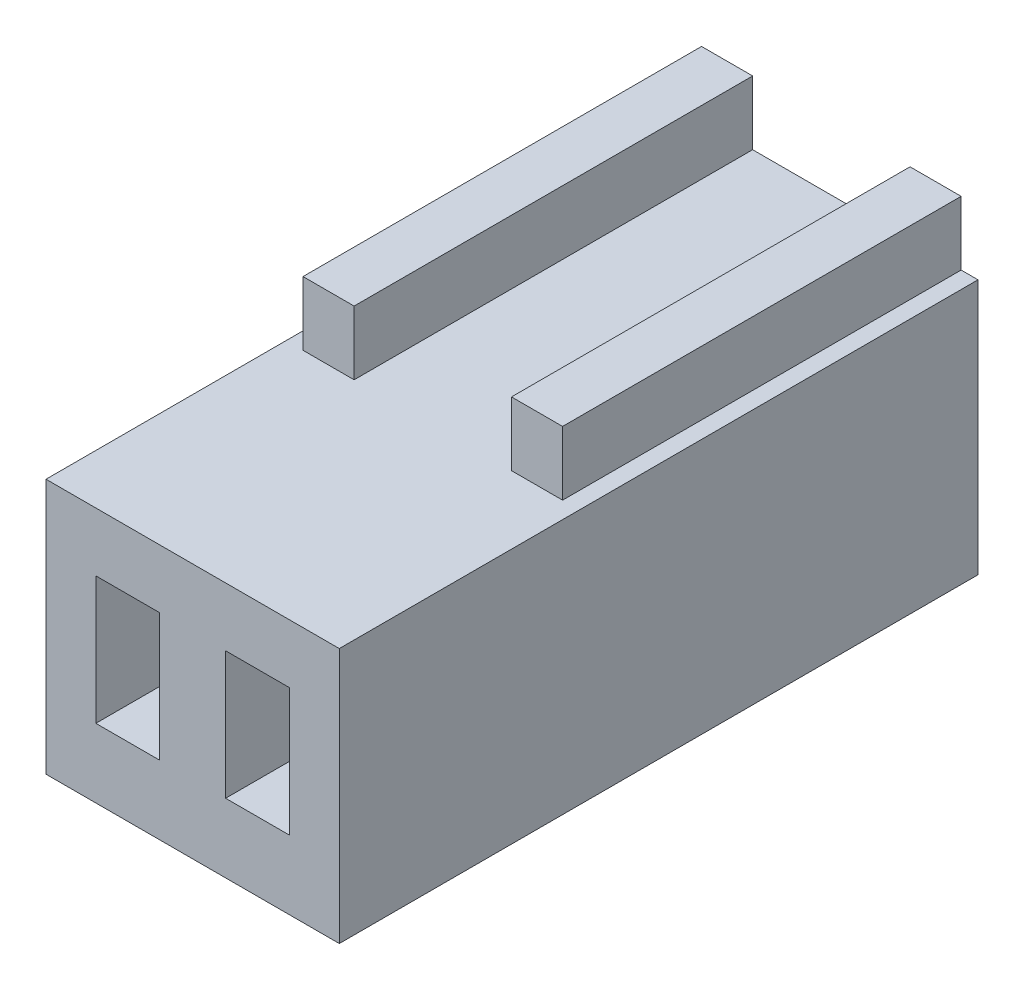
ISO-10303-21;
HEADER;
FILE_DESCRIPTION(('STEP AP214'),'2;1');
FILE_NAME('part.step','',(''),(''),'','','');
FILE_SCHEMA(('AUTOMOTIVE_DESIGN { 1 0 10303 214 1 1 1 1 }'));
ENDSEC;
DATA;
#1=APPLICATION_CONTEXT('core data for automotive mechanical design processes');
#2=APPLICATION_PROTOCOL_DEFINITION('international standard','automotive_design',2000,#1);
#3=PRODUCT_CONTEXT('',#1,'mechanical');
#4=PRODUCT('Part','Part','',(#3));
#5=PRODUCT_RELATED_PRODUCT_CATEGORY('part','',(#4));
#6=PRODUCT_DEFINITION_FORMATION('','',#4);
#7=PRODUCT_DEFINITION_CONTEXT('part definition',#1,'design');
#8=PRODUCT_DEFINITION('design','',#6,#7);
#9=PRODUCT_DEFINITION_SHAPE('','',#8);
#10=(LENGTH_UNIT() NAMED_UNIT(*) SI_UNIT(.MILLI.,.METRE.));
#11=(NAMED_UNIT(*) PLANE_ANGLE_UNIT() SI_UNIT($,.RADIAN.));
#12=(NAMED_UNIT(*) SI_UNIT($,.STERADIAN.) SOLID_ANGLE_UNIT());
#13=UNCERTAINTY_MEASURE_WITH_UNIT(LENGTH_MEASURE(1.E-05),#10,'distance_accuracy_value','');
#14=(GEOMETRIC_REPRESENTATION_CONTEXT(3) GLOBAL_UNCERTAINTY_ASSIGNED_CONTEXT((#13)) GLOBAL_UNIT_ASSIGNED_CONTEXT((#10,
#11,#12)) REPRESENTATION_CONTEXT('',''));
#15=CARTESIAN_POINT('',(0.,0.,0.));
#16=DIRECTION('',(0.,0.,1.));
#17=DIRECTION('',(1.,0.,0.));
#18=AXIS2_PLACEMENT_3D('',#15,#16,#17);
#19=CARTESIAN_POINT('',(-1.27,0.100000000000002,8.5));
#20=DIRECTION('',(0.,0.,1.));
#21=DIRECTION('',(1.,0.,0.));
#22=AXIS2_PLACEMENT_3D('',#19,#20,#21);
#23=CYLINDRICAL_SURFACE('',#22,0.5);
#24=DIRECTION('',(0.,0.,-1.));
#25=VECTOR('',#24,1.);
#26=CARTESIAN_POINT('',(-1.77,0.100000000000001,12.5));
#27=LINE('',#26,#25);
#28=CARTESIAN_POINT('',(-1.77,0.100000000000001,8.5));
#29=VERTEX_POINT('',#28);
#30=CARTESIAN_POINT('',(-1.77,0.100000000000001,10.5));
#31=VERTEX_POINT('',#30);
#32=EDGE_CURVE('E259',#29,#31,#27,.F.);
#33=ORIENTED_EDGE('',*,*,#32,.T.);
#34=CARTESIAN_POINT('',(-1.27,0.100000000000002,10.5));
#35=DIRECTION('',(0.,0.,1.));
#36=DIRECTION('',(1.,0.,0.));
#37=AXIS2_PLACEMENT_3D('',#34,#35,#36);
#38=CIRCLE('',#37,0.5);
#39=CARTESIAN_POINT('',(-0.769999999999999,0.100000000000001,10.5));
#40=VERTEX_POINT('',#39);
#41=EDGE_CURVE('E20',#40,#31,#38,.F.);
#42=ORIENTED_EDGE('',*,*,#41,.F.);
#43=DIRECTION('',(0.,0.,-1.));
#44=VECTOR('',#43,1.);
#45=CARTESIAN_POINT('',(-0.769999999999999,0.100000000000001,12.5));
#46=LINE('',#45,#44);
#47=CARTESIAN_POINT('',(-0.769999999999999,0.100000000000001,8.5));
#48=VERTEX_POINT('',#47);
#49=EDGE_CURVE('E274',#40,#48,#46,.T.);
#50=ORIENTED_EDGE('',*,*,#49,.T.);
#51=CARTESIAN_POINT('',(-1.27,0.100000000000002,8.5));
#52=DIRECTION('',(0.,0.,1.));
#53=DIRECTION('',(1.,0.,0.));
#54=AXIS2_PLACEMENT_3D('',#51,#52,#53);
#55=CIRCLE('',#54,0.5);
#56=EDGE_CURVE('E257',#29,#48,#55,.T.);
#57=ORIENTED_EDGE('',*,*,#56,.F.);
#58=EDGE_LOOP('',(#33,#42,#50,#57));
#59=FACE_BOUND('',#58,.T.);
#60=ADVANCED_FACE('F17',(#59),#23,.F.);
#61=CARTESIAN_POINT('',(-1.27,0.100000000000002,8.5));
#62=DIRECTION('',(0.,0.,1.));
#63=DIRECTION('',(1.,0.,0.));
#64=AXIS2_PLACEMENT_3D('',#61,#62,#63);
#65=PLANE('',#64);
#66=DIRECTION('',(1.,0.,0.));
#67=VECTOR('',#66,1.);
#68=CARTESIAN_POINT('',(-0.645,0.100000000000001,8.5));
#69=LINE('',#68,#67);
#70=EDGE_CURVE('E270',#48,#29,#69,.F.);
#71=ORIENTED_EDGE('',*,*,#70,.T.);
#72=ORIENTED_EDGE('',*,*,#56,.T.);
#73=EDGE_LOOP('',(#71,#72));
#74=FACE_BOUND('',#73,.T.);
#75=ADVANCED_FACE('F343',(#74),#65,.T.);
#76=CARTESIAN_POINT('',(1.27,0.100000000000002,8.5));
#77=DIRECTION('',(0.,0.,1.));
#78=DIRECTION('',(1.,0.,0.));
#79=AXIS2_PLACEMENT_3D('',#76,#77,#78);
#80=CYLINDRICAL_SURFACE('',#79,0.5);
#81=DIRECTION('',(0.,0.,-1.));
#82=VECTOR('',#81,1.);
#83=CARTESIAN_POINT('',(0.77,0.100000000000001,12.5));
#84=LINE('',#83,#82);
#85=CARTESIAN_POINT('',(0.770000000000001,0.100000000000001,8.5));
#86=VERTEX_POINT('',#85);
#87=CARTESIAN_POINT('',(0.770000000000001,0.100000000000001,10.5));
#88=VERTEX_POINT('',#87);
#89=EDGE_CURVE('E304',#86,#88,#84,.F.);
#90=ORIENTED_EDGE('',*,*,#89,.T.);
#91=CARTESIAN_POINT('',(1.27,0.100000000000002,10.5));
#92=DIRECTION('',(0.,0.,1.));
#93=DIRECTION('',(1.,0.,0.));
#94=AXIS2_PLACEMENT_3D('',#91,#92,#93);
#95=CIRCLE('',#94,0.5);
#96=CARTESIAN_POINT('',(1.77,0.100000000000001,10.5));
#97=VERTEX_POINT('',#96);
#98=EDGE_CURVE('E341',#97,#88,#95,.F.);
#99=ORIENTED_EDGE('',*,*,#98,.F.);
#100=DIRECTION('',(0.,0.,-1.));
#101=VECTOR('',#100,1.);
#102=CARTESIAN_POINT('',(1.77,0.100000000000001,12.5));
#103=LINE('',#102,#101);
#104=CARTESIAN_POINT('',(1.77,0.100000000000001,8.5));
#105=VERTEX_POINT('',#104);
#106=EDGE_CURVE('E287',#97,#105,#103,.T.);
#107=ORIENTED_EDGE('',*,*,#106,.T.);
#108=CARTESIAN_POINT('',(1.27,0.100000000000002,8.5));
#109=DIRECTION('',(0.,0.,1.));
#110=DIRECTION('',(1.,0.,0.));
#111=AXIS2_PLACEMENT_3D('',#108,#109,#110);
#112=CIRCLE('',#111,0.5);
#113=EDGE_CURVE('E286',#86,#105,#112,.T.);
#114=ORIENTED_EDGE('',*,*,#113,.F.);
#115=EDGE_LOOP('',(#90,#99,#107,#114));
#116=FACE_BOUND('',#115,.T.);
#117=ADVANCED_FACE('F726',(#116),#80,.F.);
#118=CARTESIAN_POINT('',(1.27,0.100000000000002,8.5));
#119=DIRECTION('',(0.,0.,1.));
#120=DIRECTION('',(1.,0.,0.));
#121=AXIS2_PLACEMENT_3D('',#118,#119,#120);
#122=PLANE('',#121);
#123=DIRECTION('',(1.,0.,0.));
#124=VECTOR('',#123,1.);
#125=CARTESIAN_POINT('',(1.895,0.100000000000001,8.5));
#126=LINE('',#125,#124);
#127=EDGE_CURVE('E290',#105,#86,#126,.F.);
#128=ORIENTED_EDGE('',*,*,#127,.T.);
#129=ORIENTED_EDGE('',*,*,#113,.T.);
#130=EDGE_LOOP('',(#128,#129));
#131=FACE_BOUND('',#130,.T.);
#132=ADVANCED_FACE('F738',(#131),#122,.T.);
#133=CARTESIAN_POINT('',(2.54,3.75,7.8));
#134=DIRECTION('',(0.,1.,0.));
#135=DIRECTION('',(0.,0.,1.));
#136=AXIS2_PLACEMENT_3D('',#133,#134,#135);
#137=PLANE('',#136);
#138=DIRECTION('',(1.,0.,0.));
#139=VECTOR('',#138,1.);
#140=CARTESIAN_POINT('',(0.,3.75,7.8));
#141=LINE('',#140,#139);
#142=CARTESIAN_POINT('',(2.54,3.75,7.8));
#143=VERTEX_POINT('',#142);
#144=CARTESIAN_POINT('',(1.54,3.75,7.8));
#145=VERTEX_POINT('',#144);
#146=EDGE_CURVE('E387',#143,#145,#141,.F.);
#147=ORIENTED_EDGE('',*,*,#146,.F.);
#148=DIRECTION('',(0.,0.,1.));
#149=VECTOR('',#148,1.);
#150=CARTESIAN_POINT('',(2.54,3.75,7.8));
#151=LINE('',#150,#149);
#152=CARTESIAN_POINT('',(2.54,3.75,0.));
#153=VERTEX_POINT('',#152);
#154=EDGE_CURVE('E393',#153,#143,#151,.T.);
#155=ORIENTED_EDGE('',*,*,#154,.F.);
#156=DIRECTION('',(1.,0.,0.));
#157=VECTOR('',#156,1.);
#158=CARTESIAN_POINT('',(2.54,3.75,0.));
#159=LINE('',#158,#157);
#160=CARTESIAN_POINT('',(1.54,3.75,0.));
#161=VERTEX_POINT('',#160);
#162=EDGE_CURVE('E284',#153,#161,#159,.F.);
#163=ORIENTED_EDGE('',*,*,#162,.T.);
#164=DIRECTION('',(0.,0.,1.));
#165=VECTOR('',#164,1.);
#166=CARTESIAN_POINT('',(1.54,3.75,7.8));
#167=LINE('',#166,#165);
#168=EDGE_CURVE('E384',#145,#161,#167,.F.);
#169=ORIENTED_EDGE('',*,*,#168,.F.);
#170=EDGE_LOOP('',(#147,#155,#163,#169));
#171=FACE_BOUND('',#170,.T.);
#172=ADVANCED_FACE('F740',(#171),#137,.T.);
#173=CARTESIAN_POINT('',(-2.54,3.75,7.8));
#174=DIRECTION('',(0.,-1.,0.));
#175=DIRECTION('',(0.,0.,-1.));
#176=AXIS2_PLACEMENT_3D('',#173,#174,#175);
#177=PLANE('',#176);
#178=DIRECTION('',(0.,0.,1.));
#179=VECTOR('',#178,1.);
#180=CARTESIAN_POINT('',(-2.54,3.75,7.8));
#181=LINE('',#180,#179);
#182=CARTESIAN_POINT('',(-2.54,3.75,0.));
#183=VERTEX_POINT('',#182);
#184=CARTESIAN_POINT('',(-2.54,3.75,7.8));
#185=VERTEX_POINT('',#184);
#186=EDGE_CURVE('E397',#183,#185,#181,.T.);
#187=ORIENTED_EDGE('',*,*,#186,.T.);
#188=DIRECTION('',(1.,0.,0.));
#189=VECTOR('',#188,1.);
#190=CARTESIAN_POINT('',(0.,3.75,7.8));
#191=LINE('',#190,#189);
#192=CARTESIAN_POINT('',(-1.54,3.75,7.8));
#193=VERTEX_POINT('',#192);
#194=EDGE_CURVE('E372',#193,#185,#191,.F.);
#195=ORIENTED_EDGE('',*,*,#194,.F.);
#196=DIRECTION('',(0.,0.,1.));
#197=VECTOR('',#196,1.);
#198=CARTESIAN_POINT('',(-1.54,3.75,7.8));
#199=LINE('',#198,#197);
#200=CARTESIAN_POINT('',(-1.54,3.75,0.));
#201=VERTEX_POINT('',#200);
#202=EDGE_CURVE('E377',#193,#201,#199,.F.);
#203=ORIENTED_EDGE('',*,*,#202,.T.);
#204=DIRECTION('',(1.,0.,0.));
#205=VECTOR('',#204,1.);
#206=CARTESIAN_POINT('',(-2.54,3.75,0.));
#207=LINE('',#206,#205);
#208=EDGE_CURVE('E264',#183,#201,#207,.T.);
#209=ORIENTED_EDGE('',*,*,#208,.F.);
#210=EDGE_LOOP('',(#187,#195,#203,#209));
#211=FACE_BOUND('',#210,.T.);
#212=ADVANCED_FACE('F746',(#211),#177,.F.);
#213=CARTESIAN_POINT('',(-0.645,0.100000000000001,12.5));
#214=DIRECTION('',(0.,-1.,0.));
#215=DIRECTION('',(0.,0.,-1.));
#216=AXIS2_PLACEMENT_3D('',#213,#214,#215);
#217=PLANE('',#216);
#218=ORIENTED_EDGE('',*,*,#49,.F.);
#219=DIRECTION('',(-1.,0.,0.));
#220=VECTOR('',#219,1.);
#221=CARTESIAN_POINT('',(-2.54,0.100000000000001,10.5));
#222=LINE('',#221,#220);
#223=CARTESIAN_POINT('',(-0.645,0.100000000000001,10.5));
#224=VERTEX_POINT('',#223);
#225=EDGE_CURVE('E256',#40,#224,#222,.F.);
#226=ORIENTED_EDGE('',*,*,#225,.T.);
#227=DIRECTION('',(0.,0.,1.));
#228=VECTOR('',#227,1.);
#229=CARTESIAN_POINT('',(-0.645,0.100000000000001,12.5));
#230=LINE('',#229,#228);
#231=CARTESIAN_POINT('',(-0.645,0.100000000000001,0.));
#232=VERTEX_POINT('',#231);
#233=EDGE_CURVE('E322',#224,#232,#230,.F.);
#234=ORIENTED_EDGE('',*,*,#233,.T.);
#235=DIRECTION('',(1.,0.,0.));
#236=VECTOR('',#235,1.);
#237=CARTESIAN_POINT('',(-0.645,0.100000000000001,0.));
#238=LINE('',#237,#236);
#239=CARTESIAN_POINT('',(-1.895,0.100000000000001,0.));
#240=VERTEX_POINT('',#239);
#241=EDGE_CURVE('E263',#240,#232,#238,.T.);
#242=ORIENTED_EDGE('',*,*,#241,.F.);
#243=DIRECTION('',(0.,0.,1.));
#244=VECTOR('',#243,1.);
#245=CARTESIAN_POINT('',(-1.895,0.100000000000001,12.5));
#246=LINE('',#245,#244);
#247=CARTESIAN_POINT('',(-1.895,0.100000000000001,10.5));
#248=VERTEX_POINT('',#247);
#249=EDGE_CURVE('E269',#240,#248,#246,.T.);
#250=ORIENTED_EDGE('',*,*,#249,.T.);
#251=DIRECTION('',(-1.,0.,0.));
#252=VECTOR('',#251,1.);
#253=CARTESIAN_POINT('',(-2.54,0.100000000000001,10.5));
#254=LINE('',#253,#252);
#255=EDGE_CURVE('E253',#248,#31,#254,.F.);
#256=ORIENTED_EDGE('',*,*,#255,.T.);
#257=ORIENTED_EDGE('',*,*,#32,.F.);
#258=ORIENTED_EDGE('',*,*,#70,.F.);
#259=EDGE_LOOP('',(#218,#226,#234,#242,#250,#256,#257,#258));
#260=FACE_BOUND('',#259,.T.);
#261=ADVANCED_FACE('F267',(#260),#217,.F.);
#262=CARTESIAN_POINT('',(-2.54,0.,10.5));
#263=DIRECTION('',(0.,0.,-1.));
#264=DIRECTION('',(-1.,0.,0.));
#265=AXIS2_PLACEMENT_3D('',#262,#263,#264);
#266=PLANE('',#265);
#267=ORIENTED_EDGE('',*,*,#41,.T.);
#268=ORIENTED_EDGE('',*,*,#255,.F.);
#269=DIRECTION('',(0.,-1.,0.));
#270=VECTOR('',#269,1.);
#271=CARTESIAN_POINT('',(-1.895,1.35,10.5));
#272=LINE('',#271,#270);
#273=CARTESIAN_POINT('',(-1.895,-1.15,10.5));
#274=VERTEX_POINT('',#273);
#275=EDGE_CURVE('E332',#248,#274,#272,.T.);
#276=ORIENTED_EDGE('',*,*,#275,.T.);
#277=DIRECTION('',(1.,0.,0.));
#278=VECTOR('',#277,1.);
#279=CARTESIAN_POINT('',(-1.895,-1.15,10.5));
#280=LINE('',#279,#278);
#281=CARTESIAN_POINT('',(-0.645,-1.15,10.5));
#282=VERTEX_POINT('',#281);
#283=EDGE_CURVE('E272',#274,#282,#280,.T.);
#284=ORIENTED_EDGE('',*,*,#283,.T.);
#285=DIRECTION('',(0.,1.,0.));
#286=VECTOR('',#285,1.);
#287=CARTESIAN_POINT('',(-0.645,1.35,10.5));
#288=LINE('',#287,#286);
#289=EDGE_CURVE('E325',#282,#224,#288,.T.);
#290=ORIENTED_EDGE('',*,*,#289,.T.);
#291=ORIENTED_EDGE('',*,*,#225,.F.);
#292=EDGE_LOOP('',(#267,#268,#276,#284,#290,#291));
#293=FACE_BOUND('',#292,.T.);
#294=ADVANCED_FACE('F250',(#293),#266,.F.);
#295=CARTESIAN_POINT('',(-1.895,-1.15,10.5));
#296=DIRECTION('',(0.,-1.,0.));
#297=DIRECTION('',(0.,0.,-1.));
#298=AXIS2_PLACEMENT_3D('',#295,#296,#297);
#299=PLANE('',#298);
#300=DIRECTION('',(0.,0.,1.));
#301=VECTOR('',#300,1.);
#302=CARTESIAN_POINT('',(-0.645000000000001,-1.15,12.5));
#303=LINE('',#302,#301);
#304=CARTESIAN_POINT('',(-0.645,-1.15,12.5));
#305=VERTEX_POINT('',#304);
#306=EDGE_CURVE('E329',#305,#282,#303,.F.);
#307=ORIENTED_EDGE('',*,*,#306,.T.);
#308=ORIENTED_EDGE('',*,*,#283,.F.);
#309=DIRECTION('',(0.,0.,1.));
#310=VECTOR('',#309,1.);
#311=CARTESIAN_POINT('',(-1.895,-1.15,12.5));
#312=LINE('',#311,#310);
#313=CARTESIAN_POINT('',(-1.895,-1.15,12.5));
#314=VERTEX_POINT('',#313);
#315=EDGE_CURVE('E334',#274,#314,#312,.T.);
#316=ORIENTED_EDGE('',*,*,#315,.T.);
#317=DIRECTION('',(1.,0.,0.));
#318=VECTOR('',#317,1.);
#319=CARTESIAN_POINT('',(-1.895,-1.15,12.5));
#320=LINE('',#319,#318);
#321=EDGE_CURVE('E307',#305,#314,#320,.F.);
#322=ORIENTED_EDGE('',*,*,#321,.F.);
#323=EDGE_LOOP('',(#307,#308,#316,#322));
#324=FACE_BOUND('',#323,.T.);
#325=ADVANCED_FACE('F603',(#324),#299,.F.);
#326=CARTESIAN_POINT('',(1.895,0.100000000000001,12.5));
#327=DIRECTION('',(0.,-1.,0.));
#328=DIRECTION('',(0.,0.,-1.));
#329=AXIS2_PLACEMENT_3D('',#326,#327,#328);
#330=PLANE('',#329);
#331=ORIENTED_EDGE('',*,*,#106,.F.);
#332=DIRECTION('',(-1.,0.,0.));
#333=VECTOR('',#332,1.);
#334=CARTESIAN_POINT('',(0.,0.100000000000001,10.5));
#335=LINE('',#334,#333);
#336=CARTESIAN_POINT('',(1.895,0.100000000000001,10.5));
#337=VERTEX_POINT('',#336);
#338=EDGE_CURVE('E364',#97,#337,#335,.F.);
#339=ORIENTED_EDGE('',*,*,#338,.T.);
#340=DIRECTION('',(0.,0.,1.));
#341=VECTOR('',#340,1.);
#342=CARTESIAN_POINT('',(1.895,0.100000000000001,12.5));
#343=LINE('',#342,#341);
#344=CARTESIAN_POINT('',(1.895,0.100000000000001,0.));
#345=VERTEX_POINT('',#344);
#346=EDGE_CURVE('E292',#337,#345,#343,.F.);
#347=ORIENTED_EDGE('',*,*,#346,.T.);
#348=DIRECTION('',(1.,0.,0.));
#349=VECTOR('',#348,1.);
#350=CARTESIAN_POINT('',(1.895,0.100000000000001,0.));
#351=LINE('',#350,#349);
#352=CARTESIAN_POINT('',(0.645,0.100000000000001,0.));
#353=VERTEX_POINT('',#352);
#354=EDGE_CURVE('E291',#353,#345,#351,.T.);
#355=ORIENTED_EDGE('',*,*,#354,.F.);
#356=DIRECTION('',(0.,0.,1.));
#357=VECTOR('',#356,1.);
#358=CARTESIAN_POINT('',(0.645,0.100000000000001,12.5));
#359=LINE('',#358,#357);
#360=CARTESIAN_POINT('',(0.644999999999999,0.100000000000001,10.5));
#361=VERTEX_POINT('',#360);
#362=EDGE_CURVE('E295',#353,#361,#359,.T.);
#363=ORIENTED_EDGE('',*,*,#362,.T.);
#364=DIRECTION('',(-1.,0.,0.));
#365=VECTOR('',#364,1.);
#366=CARTESIAN_POINT('',(0.,0.100000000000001,10.5));
#367=LINE('',#366,#365);
#368=EDGE_CURVE('E320',#361,#88,#367,.F.);
#369=ORIENTED_EDGE('',*,*,#368,.T.);
#370=ORIENTED_EDGE('',*,*,#89,.F.);
#371=ORIENTED_EDGE('',*,*,#127,.F.);
#372=EDGE_LOOP('',(#331,#339,#347,#355,#363,#369,#370,#371));
#373=FACE_BOUND('',#372,.T.);
#374=ADVANCED_FACE('F605',(#373),#330,.F.);
#375=CARTESIAN_POINT('',(0.,0.,10.5));
#376=DIRECTION('',(0.,0.,-1.));
#377=DIRECTION('',(-1.,0.,0.));
#378=AXIS2_PLACEMENT_3D('',#375,#376,#377);
#379=PLANE('',#378);
#380=ORIENTED_EDGE('',*,*,#98,.T.);
#381=ORIENTED_EDGE('',*,*,#368,.F.);
#382=DIRECTION('',(0.,-1.,0.));
#383=VECTOR('',#382,1.);
#384=CARTESIAN_POINT('',(0.645,1.35,10.5));
#385=LINE('',#384,#383);
#386=CARTESIAN_POINT('',(0.644999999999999,-1.15,10.5));
#387=VERTEX_POINT('',#386);
#388=EDGE_CURVE('E308',#361,#387,#385,.T.);
#389=ORIENTED_EDGE('',*,*,#388,.T.);
#390=DIRECTION('',(1.,0.,0.));
#391=VECTOR('',#390,1.);
#392=CARTESIAN_POINT('',(0.644999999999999,-1.15,10.5));
#393=LINE('',#392,#391);
#394=CARTESIAN_POINT('',(1.895,-1.15,10.5));
#395=VERTEX_POINT('',#394);
#396=EDGE_CURVE('E368',#387,#395,#393,.T.);
#397=ORIENTED_EDGE('',*,*,#396,.T.);
#398=DIRECTION('',(0.,1.,0.));
#399=VECTOR('',#398,1.);
#400=CARTESIAN_POINT('',(1.895,1.35,10.5));
#401=LINE('',#400,#399);
#402=EDGE_CURVE('E296',#395,#337,#401,.T.);
#403=ORIENTED_EDGE('',*,*,#402,.T.);
#404=ORIENTED_EDGE('',*,*,#338,.F.);
#405=EDGE_LOOP('',(#380,#381,#389,#397,#403,#404));
#406=FACE_BOUND('',#405,.T.);
#407=ADVANCED_FACE('F612',(#406),#379,.F.);
#408=CARTESIAN_POINT('',(0.644999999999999,-1.15,10.5));
#409=DIRECTION('',(0.,-1.,0.));
#410=DIRECTION('',(0.,0.,-1.));
#411=AXIS2_PLACEMENT_3D('',#408,#409,#410);
#412=PLANE('',#411);
#413=DIRECTION('',(0.,0.,1.));
#414=VECTOR('',#413,1.);
#415=CARTESIAN_POINT('',(1.895,-1.15,12.5));
#416=LINE('',#415,#414);
#417=CARTESIAN_POINT('',(1.895,-1.15,12.5));
#418=VERTEX_POINT('',#417);
#419=EDGE_CURVE('E301',#418,#395,#416,.F.);
#420=ORIENTED_EDGE('',*,*,#419,.T.);
#421=ORIENTED_EDGE('',*,*,#396,.F.);
#422=DIRECTION('',(0.,0.,1.));
#423=VECTOR('',#422,1.);
#424=CARTESIAN_POINT('',(0.645,-1.15,12.5));
#425=LINE('',#424,#423);
#426=CARTESIAN_POINT('',(0.644999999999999,-1.15,12.5));
#427=VERTEX_POINT('',#426);
#428=EDGE_CURVE('E311',#387,#427,#425,.T.);
#429=ORIENTED_EDGE('',*,*,#428,.T.);
#430=DIRECTION('',(1.,0.,0.));
#431=VECTOR('',#430,1.);
#432=CARTESIAN_POINT('',(0.644999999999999,-1.15,12.5));
#433=LINE('',#432,#431);
#434=EDGE_CURVE('E370',#418,#427,#433,.F.);
#435=ORIENTED_EDGE('',*,*,#434,.F.);
#436=EDGE_LOOP('',(#420,#421,#429,#435));
#437=FACE_BOUND('',#436,.T.);
#438=ADVANCED_FACE('F712',(#437),#412,.F.);
#439=CARTESIAN_POINT('',(0.,0.,7.8));
#440=DIRECTION('',(0.,0.,1.));
#441=DIRECTION('',(1.,0.,0.));
#442=AXIS2_PLACEMENT_3D('',#439,#440,#441);
#443=PLANE('',#442);
#444=DIRECTION('',(0.,1.,0.));
#445=VECTOR('',#444,1.);
#446=CARTESIAN_POINT('',(-1.54,2.5,7.8));
#447=LINE('',#446,#445);
#448=CARTESIAN_POINT('',(-1.54,2.5,7.8));
#449=VERTEX_POINT('',#448);
#450=EDGE_CURVE('E374',#449,#193,#447,.T.);
#451=ORIENTED_EDGE('',*,*,#450,.T.);
#452=ORIENTED_EDGE('',*,*,#194,.T.);
#453=DIRECTION('',(0.,1.,0.));
#454=VECTOR('',#453,1.);
#455=CARTESIAN_POINT('',(-2.54,2.5,7.8));
#456=LINE('',#455,#454);
#457=CARTESIAN_POINT('',(-2.54,2.5,7.8));
#458=VERTEX_POINT('',#457);
#459=EDGE_CURVE('E400',#185,#458,#456,.F.);
#460=ORIENTED_EDGE('',*,*,#459,.T.);
#461=DIRECTION('',(1.,0.,0.));
#462=VECTOR('',#461,1.);
#463=CARTESIAN_POINT('',(-2.87,2.5,7.8));
#464=LINE('',#463,#462);
#465=EDGE_CURVE('E434',#458,#449,#464,.T.);
#466=ORIENTED_EDGE('',*,*,#465,.T.);
#467=EDGE_LOOP('',(#451,#452,#460,#466));
#468=FACE_BOUND('',#467,.T.);
#469=ADVANCED_FACE('F708',(#468),#443,.T.);
#470=CARTESIAN_POINT('',(-1.54,2.5,7.8));
#471=DIRECTION('',(-1.,0.,0.));
#472=DIRECTION('',(0.,0.,1.));
#473=AXIS2_PLACEMENT_3D('',#470,#471,#472);
#474=PLANE('',#473);
#475=ORIENTED_EDGE('',*,*,#202,.F.);
#476=ORIENTED_EDGE('',*,*,#450,.F.);
#477=DIRECTION('',(0.,0.,-1.));
#478=VECTOR('',#477,1.);
#479=CARTESIAN_POINT('',(-1.54,2.5,12.5));
#480=LINE('',#479,#478);
#481=CARTESIAN_POINT('',(-1.54,2.5,0.));
#482=VERTEX_POINT('',#481);
#483=EDGE_CURVE('E437',#449,#482,#480,.T.);
#484=ORIENTED_EDGE('',*,*,#483,.T.);
#485=DIRECTION('',(0.,1.,0.));
#486=VECTOR('',#485,1.);
#487=CARTESIAN_POINT('',(-1.54,2.5,0.));
#488=LINE('',#487,#486);
#489=EDGE_CURVE('E380',#201,#482,#488,.F.);
#490=ORIENTED_EDGE('',*,*,#489,.F.);
#491=EDGE_LOOP('',(#475,#476,#484,#490));
#492=FACE_BOUND('',#491,.T.);
#493=ADVANCED_FACE('F704',(#492),#474,.F.);
#494=CARTESIAN_POINT('',(1.54,2.5,7.8));
#495=DIRECTION('',(-1.,0.,0.));
#496=DIRECTION('',(0.,0.,1.));
#497=AXIS2_PLACEMENT_3D('',#494,#495,#496);
#498=PLANE('',#497);
#499=DIRECTION('',(0.,1.,0.));
#500=VECTOR('',#499,1.);
#501=CARTESIAN_POINT('',(1.54,0.,7.8));
#502=LINE('',#501,#500);
#503=CARTESIAN_POINT('',(1.54,2.5,7.8));
#504=VERTEX_POINT('',#503);
#505=EDGE_CURVE('E389',#145,#504,#502,.F.);
#506=ORIENTED_EDGE('',*,*,#505,.F.);
#507=ORIENTED_EDGE('',*,*,#168,.T.);
#508=DIRECTION('',(0.,1.,0.));
#509=VECTOR('',#508,1.);
#510=CARTESIAN_POINT('',(1.54,2.5,0.));
#511=LINE('',#510,#509);
#512=CARTESIAN_POINT('',(1.54,2.5,0.));
#513=VERTEX_POINT('',#512);
#514=EDGE_CURVE('E382',#161,#513,#511,.F.);
#515=ORIENTED_EDGE('',*,*,#514,.T.);
#516=DIRECTION('',(0.,0.,-1.));
#517=VECTOR('',#516,1.);
#518=CARTESIAN_POINT('',(1.54,2.5,12.5));
#519=LINE('',#518,#517);
#520=EDGE_CURVE('E440',#513,#504,#519,.F.);
#521=ORIENTED_EDGE('',*,*,#520,.T.);
#522=EDGE_LOOP('',(#506,#507,#515,#521));
#523=FACE_BOUND('',#522,.T.);
#524=ADVANCED_FACE('F700',(#523),#498,.T.);
#525=CARTESIAN_POINT('',(0.,0.,7.8));
#526=DIRECTION('',(0.,0.,1.));
#527=DIRECTION('',(1.,0.,0.));
#528=AXIS2_PLACEMENT_3D('',#525,#526,#527);
#529=PLANE('',#528);
#530=ORIENTED_EDGE('',*,*,#505,.T.);
#531=DIRECTION('',(1.,0.,0.));
#532=VECTOR('',#531,1.);
#533=CARTESIAN_POINT('',(-2.87,2.5,7.8));
#534=LINE('',#533,#532);
#535=CARTESIAN_POINT('',(2.54,2.5,7.8));
#536=VERTEX_POINT('',#535);
#537=EDGE_CURVE('E443',#504,#536,#534,.T.);
#538=ORIENTED_EDGE('',*,*,#537,.T.);
#539=DIRECTION('',(0.,1.,0.));
#540=VECTOR('',#539,1.);
#541=CARTESIAN_POINT('',(2.54,2.5,7.8));
#542=LINE('',#541,#540);
#543=EDGE_CURVE('E395',#143,#536,#542,.F.);
#544=ORIENTED_EDGE('',*,*,#543,.F.);
#545=ORIENTED_EDGE('',*,*,#146,.T.);
#546=EDGE_LOOP('',(#530,#538,#544,#545));
#547=FACE_BOUND('',#546,.T.);
#548=ADVANCED_FACE('F696',(#547),#529,.T.);
#549=CARTESIAN_POINT('',(2.54,2.5,7.8));
#550=DIRECTION('',(1.,0.,0.));
#551=DIRECTION('',(0.,1.,0.));
#552=AXIS2_PLACEMENT_3D('',#549,#550,#551);
#553=PLANE('',#552);
#554=ORIENTED_EDGE('',*,*,#543,.T.);
#555=DIRECTION('',(0.,0.,-1.));
#556=VECTOR('',#555,1.);
#557=CARTESIAN_POINT('',(2.54,2.5,12.5));
#558=LINE('',#557,#556);
#559=CARTESIAN_POINT('',(2.54,2.5,0.));
#560=VERTEX_POINT('',#559);
#561=EDGE_CURVE('E446',#536,#560,#558,.T.);
#562=ORIENTED_EDGE('',*,*,#561,.T.);
#563=DIRECTION('',(0.,1.,0.));
#564=VECTOR('',#563,1.);
#565=CARTESIAN_POINT('',(2.54,2.5,0.));
#566=LINE('',#565,#564);
#567=EDGE_CURVE('E391',#560,#153,#566,.T.);
#568=ORIENTED_EDGE('',*,*,#567,.T.);
#569=ORIENTED_EDGE('',*,*,#154,.T.);
#570=EDGE_LOOP('',(#554,#562,#568,#569));
#571=FACE_BOUND('',#570,.T.);
#572=ADVANCED_FACE('F692',(#571),#553,.T.);
#573=CARTESIAN_POINT('',(-2.54,2.5,7.8));
#574=DIRECTION('',(1.,0.,0.));
#575=DIRECTION('',(0.,1.,0.));
#576=AXIS2_PLACEMENT_3D('',#573,#574,#575);
#577=PLANE('',#576);
#578=DIRECTION('',(0.,0.,-1.));
#579=VECTOR('',#578,1.);
#580=CARTESIAN_POINT('',(-2.54,2.5,12.5));
#581=LINE('',#580,#579);
#582=CARTESIAN_POINT('',(-2.54,2.5,0.));
#583=VERTEX_POINT('',#582);
#584=EDGE_CURVE('E452',#583,#458,#581,.F.);
#585=ORIENTED_EDGE('',*,*,#584,.T.);
#586=ORIENTED_EDGE('',*,*,#459,.F.);
#587=ORIENTED_EDGE('',*,*,#186,.F.);
#588=DIRECTION('',(0.,1.,0.));
#589=VECTOR('',#588,1.);
#590=CARTESIAN_POINT('',(-2.54,2.5,0.));
#591=LINE('',#590,#589);
#592=EDGE_CURVE('E403',#583,#183,#591,.T.);
#593=ORIENTED_EDGE('',*,*,#592,.F.);
#594=EDGE_LOOP('',(#585,#586,#587,#593));
#595=FACE_BOUND('',#594,.T.);
#596=ADVANCED_FACE('F688',(#595),#577,.F.);
#597=CARTESIAN_POINT('',(0.,-1.5,0.));
#598=DIRECTION('',(0.,1.,0.));
#599=DIRECTION('',(0.,0.,1.));
#600=AXIS2_PLACEMENT_3D('',#597,#598,#599);
#601=PLANE('',#600);
#602=DIRECTION('',(0.,0.,-1.));
#603=VECTOR('',#602,1.);
#604=CARTESIAN_POINT('',(1.72,-1.5,1.8));
#605=LINE('',#604,#603);
#606=CARTESIAN_POINT('',(1.72,-1.5,1.8));
#607=VERTEX_POINT('',#606);
#608=CARTESIAN_POINT('',(1.72,-1.5,4.98));
#609=VERTEX_POINT('',#608);
#610=EDGE_CURVE('E470',#607,#609,#605,.F.);
#611=ORIENTED_EDGE('',*,*,#610,.T.);
#612=DIRECTION('',(1.,0.,0.));
#613=VECTOR('',#612,1.);
#614=CARTESIAN_POINT('',(1.72,-1.5,4.98));
#615=LINE('',#614,#613);
#616=CARTESIAN_POINT('',(0.72,-1.5,4.98));
#617=VERTEX_POINT('',#616);
#618=EDGE_CURVE('E455',#609,#617,#615,.F.);
#619=ORIENTED_EDGE('',*,*,#618,.T.);
#620=DIRECTION('',(0.,0.,1.));
#621=VECTOR('',#620,1.);
#622=CARTESIAN_POINT('',(0.72,-1.5,1.8));
#623=LINE('',#622,#621);
#624=CARTESIAN_POINT('',(0.72,-1.5,1.8));
#625=VERTEX_POINT('',#624);
#626=EDGE_CURVE('E460',#617,#625,#623,.F.);
#627=ORIENTED_EDGE('',*,*,#626,.T.);
#628=DIRECTION('',(-1.,0.,0.));
#629=VECTOR('',#628,1.);
#630=CARTESIAN_POINT('',(1.72,-1.5,1.8));
#631=LINE('',#630,#629);
#632=EDGE_CURVE('E465',#625,#607,#631,.F.);
#633=ORIENTED_EDGE('',*,*,#632,.T.);
#634=EDGE_LOOP('',(#611,#619,#627,#633));
#635=FACE_BOUND('',#634,.T.);
#636=ADVANCED_FACE('F684',(#635),#601,.F.);
#637=CARTESIAN_POINT('',(0.,-1.5,0.));
#638=DIRECTION('',(0.,1.,0.));
#639=DIRECTION('',(0.,0.,1.));
#640=AXIS2_PLACEMENT_3D('',#637,#638,#639);
#641=PLANE('',#640);
#642=DIRECTION('',(1.,0.,0.));
#643=VECTOR('',#642,1.);
#644=CARTESIAN_POINT('',(0.,-1.5,1.8));
#645=LINE('',#644,#643);
#646=CARTESIAN_POINT('',(-0.72,-1.5,1.8));
#647=VERTEX_POINT('',#646);
#648=CARTESIAN_POINT('',(-1.72,-1.5,1.8));
#649=VERTEX_POINT('',#648);
#650=EDGE_CURVE('E406',#647,#649,#645,.F.);
#651=ORIENTED_EDGE('',*,*,#650,.F.);
#652=DIRECTION('',(0.,0.,-1.));
#653=VECTOR('',#652,1.);
#654=CARTESIAN_POINT('',(-0.72,-1.5,1.8));
#655=LINE('',#654,#653);
#656=CARTESIAN_POINT('',(-0.72,-1.5,4.98));
#657=VERTEX_POINT('',#656);
#658=EDGE_CURVE('E476',#647,#657,#655,.F.);
#659=ORIENTED_EDGE('',*,*,#658,.T.);
#660=DIRECTION('',(1.,0.,0.));
#661=VECTOR('',#660,1.);
#662=CARTESIAN_POINT('',(-1.72,-1.5,4.98));
#663=LINE('',#662,#661);
#664=CARTESIAN_POINT('',(-1.72,-1.5,4.98));
#665=VERTEX_POINT('',#664);
#666=EDGE_CURVE('E481',#657,#665,#663,.F.);
#667=ORIENTED_EDGE('',*,*,#666,.T.);
#668=DIRECTION('',(0.,0.,1.));
#669=VECTOR('',#668,1.);
#670=CARTESIAN_POINT('',(-1.72,-1.5,1.8));
#671=LINE('',#670,#669);
#672=EDGE_CURVE('E486',#665,#649,#671,.F.);
#673=ORIENTED_EDGE('',*,*,#672,.T.);
#674=EDGE_LOOP('',(#651,#659,#667,#673));
#675=FACE_BOUND('',#674,.T.);
#676=ADVANCED_FACE('F681',(#675),#641,.F.);
#677=CARTESIAN_POINT('',(-0.645,1.35,12.5));
#678=DIRECTION('',(1.,0.,0.));
#679=DIRECTION('',(0.,1.,0.));
#680=AXIS2_PLACEMENT_3D('',#677,#678,#679);
#681=PLANE('',#680);
#682=ORIENTED_EDGE('',*,*,#289,.F.);
#683=ORIENTED_EDGE('',*,*,#306,.F.);
#684=DIRECTION('',(0.,1.,0.));
#685=VECTOR('',#684,1.);
#686=CARTESIAN_POINT('',(-0.645,0.,12.5));
#687=LINE('',#686,#685);
#688=CARTESIAN_POINT('',(-0.645,1.35,12.5));
#689=VERTEX_POINT('',#688);
#690=EDGE_CURVE('E498',#689,#305,#687,.F.);
#691=ORIENTED_EDGE('',*,*,#690,.F.);
#692=DIRECTION('',(0.,0.,1.));
#693=VECTOR('',#692,1.);
#694=CARTESIAN_POINT('',(-0.645,1.35,12.5));
#695=LINE('',#694,#693);
#696=CARTESIAN_POINT('',(-0.645,1.35,0.));
#697=VERTEX_POINT('',#696);
#698=EDGE_CURVE('E426',#689,#697,#695,.F.);
#699=ORIENTED_EDGE('',*,*,#698,.T.);
#700=DIRECTION('',(0.,1.,0.));
#701=VECTOR('',#700,1.);
#702=CARTESIAN_POINT('',(-0.645,1.35,0.));
#703=LINE('',#702,#701);
#704=EDGE_CURVE('E351',#232,#697,#703,.T.);
#705=ORIENTED_EDGE('',*,*,#704,.F.);
#706=ORIENTED_EDGE('',*,*,#233,.F.);
#707=EDGE_LOOP('',(#682,#683,#691,#699,#705,#706));
#708=FACE_BOUND('',#707,.T.);
#709=ADVANCED_FACE('F347',(#708),#681,.F.);
#710=CARTESIAN_POINT('',(-1.895,1.35,12.5));
#711=DIRECTION('',(-1.,0.,0.));
#712=DIRECTION('',(0.,-1.,0.));
#713=AXIS2_PLACEMENT_3D('',#710,#711,#712);
#714=PLANE('',#713);
#715=DIRECTION('',(0.,0.,1.));
#716=VECTOR('',#715,1.);
#717=CARTESIAN_POINT('',(-1.895,1.35,12.5));
#718=LINE('',#717,#716);
#719=CARTESIAN_POINT('',(-1.895,1.35,0.));
#720=VERTEX_POINT('',#719);
#721=CARTESIAN_POINT('',(-1.895,1.35,12.5));
#722=VERTEX_POINT('',#721);
#723=EDGE_CURVE('E423',#720,#722,#718,.T.);
#724=ORIENTED_EDGE('',*,*,#723,.T.);
#725=DIRECTION('',(0.,1.,0.));
#726=VECTOR('',#725,1.);
#727=CARTESIAN_POINT('',(-1.895,0.,12.5));
#728=LINE('',#727,#726);
#729=EDGE_CURVE('E501',#314,#722,#728,.T.);
#730=ORIENTED_EDGE('',*,*,#729,.F.);
#731=ORIENTED_EDGE('',*,*,#315,.F.);
#732=ORIENTED_EDGE('',*,*,#275,.F.);
#733=ORIENTED_EDGE('',*,*,#249,.F.);
#734=DIRECTION('',(0.,-1.,0.));
#735=VECTOR('',#734,1.);
#736=CARTESIAN_POINT('',(-1.895,1.35,0.));
#737=LINE('',#736,#735);
#738=EDGE_CURVE('E411',#720,#240,#737,.T.);
#739=ORIENTED_EDGE('',*,*,#738,.F.);
#740=EDGE_LOOP('',(#724,#730,#731,#732,#733,#739));
#741=FACE_BOUND('',#740,.T.);
#742=ADVANCED_FACE('F596',(#741),#714,.F.);
#743=CARTESIAN_POINT('',(1.895,1.35,12.5));
#744=DIRECTION('',(1.,0.,0.));
#745=DIRECTION('',(0.,1.,0.));
#746=AXIS2_PLACEMENT_3D('',#743,#744,#745);
#747=PLANE('',#746);
#748=ORIENTED_EDGE('',*,*,#402,.F.);
#749=ORIENTED_EDGE('',*,*,#419,.F.);
#750=DIRECTION('',(0.,1.,0.));
#751=VECTOR('',#750,1.);
#752=CARTESIAN_POINT('',(1.895,0.,12.5));
#753=LINE('',#752,#751);
#754=CARTESIAN_POINT('',(1.895,1.35,12.5));
#755=VERTEX_POINT('',#754);
#756=EDGE_CURVE('E506',#755,#418,#753,.F.);
#757=ORIENTED_EDGE('',*,*,#756,.F.);
#758=DIRECTION('',(0.,0.,1.));
#759=VECTOR('',#758,1.);
#760=CARTESIAN_POINT('',(1.895,1.35,12.5));
#761=LINE('',#760,#759);
#762=CARTESIAN_POINT('',(1.895,1.35,0.));
#763=VERTEX_POINT('',#762);
#764=EDGE_CURVE('E431',#755,#763,#761,.F.);
#765=ORIENTED_EDGE('',*,*,#764,.T.);
#766=DIRECTION('',(0.,1.,0.));
#767=VECTOR('',#766,1.);
#768=CARTESIAN_POINT('',(1.895,1.35,0.));
#769=LINE('',#768,#767);
#770=EDGE_CURVE('E414',#345,#763,#769,.T.);
#771=ORIENTED_EDGE('',*,*,#770,.F.);
#772=ORIENTED_EDGE('',*,*,#346,.F.);
#773=EDGE_LOOP('',(#748,#749,#757,#765,#771,#772));
#774=FACE_BOUND('',#773,.T.);
#775=ADVANCED_FACE('F672',(#774),#747,.F.);
#776=CARTESIAN_POINT('',(0.645,1.35,12.5));
#777=DIRECTION('',(-1.,0.,0.));
#778=DIRECTION('',(0.,-1.,0.));
#779=AXIS2_PLACEMENT_3D('',#776,#777,#778);
#780=PLANE('',#779);
#781=DIRECTION('',(0.,0.,1.));
#782=VECTOR('',#781,1.);
#783=CARTESIAN_POINT('',(0.645,1.35,12.5));
#784=LINE('',#783,#782);
#785=CARTESIAN_POINT('',(0.645,1.35,0.));
#786=VERTEX_POINT('',#785);
#787=CARTESIAN_POINT('',(0.645,1.35,12.5));
#788=VERTEX_POINT('',#787);
#789=EDGE_CURVE('E428',#786,#788,#784,.T.);
#790=ORIENTED_EDGE('',*,*,#789,.T.);
#791=DIRECTION('',(0.,1.,0.));
#792=VECTOR('',#791,1.);
#793=CARTESIAN_POINT('',(0.644999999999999,0.,12.5));
#794=LINE('',#793,#792);
#795=EDGE_CURVE('E509',#427,#788,#794,.T.);
#796=ORIENTED_EDGE('',*,*,#795,.F.);
#797=ORIENTED_EDGE('',*,*,#428,.F.);
#798=ORIENTED_EDGE('',*,*,#388,.F.);
#799=ORIENTED_EDGE('',*,*,#362,.F.);
#800=DIRECTION('',(0.,-1.,0.));
#801=VECTOR('',#800,1.);
#802=CARTESIAN_POINT('',(0.645,1.35,0.));
#803=LINE('',#802,#801);
#804=EDGE_CURVE('E420',#786,#353,#803,.T.);
#805=ORIENTED_EDGE('',*,*,#804,.F.);
#806=EDGE_LOOP('',(#790,#796,#797,#798,#799,#805));
#807=FACE_BOUND('',#806,.T.);
#808=ADVANCED_FACE('F669',(#807),#780,.F.);
#809=CARTESIAN_POINT('',(-0.645,1.35,12.5));
#810=DIRECTION('',(0.,1.,0.));
#811=DIRECTION('',(0.,0.,1.));
#812=AXIS2_PLACEMENT_3D('',#809,#810,#811);
#813=PLANE('',#812);
#814=ORIENTED_EDGE('',*,*,#698,.F.);
#815=DIRECTION('',(1.,0.,0.));
#816=VECTOR('',#815,1.);
#817=CARTESIAN_POINT('',(0.,1.35,12.5));
#818=LINE('',#817,#816);
#819=EDGE_CURVE('E503',#722,#689,#818,.T.);
#820=ORIENTED_EDGE('',*,*,#819,.F.);
#821=ORIENTED_EDGE('',*,*,#723,.F.);
#822=DIRECTION('',(1.,0.,0.));
#823=VECTOR('',#822,1.);
#824=CARTESIAN_POINT('',(0.,1.35,0.));
#825=LINE('',#824,#823);
#826=EDGE_CURVE('E524',#720,#697,#825,.T.);
#827=ORIENTED_EDGE('',*,*,#826,.T.);
#828=EDGE_LOOP('',(#814,#820,#821,#827));
#829=FACE_BOUND('',#828,.T.);
#830=ADVANCED_FACE('F600',(#829),#813,.F.);
#831=CARTESIAN_POINT('',(1.895,1.35,12.5));
#832=DIRECTION('',(0.,1.,0.));
#833=DIRECTION('',(0.,0.,1.));
#834=AXIS2_PLACEMENT_3D('',#831,#832,#833);
#835=PLANE('',#834);
#836=ORIENTED_EDGE('',*,*,#764,.F.);
#837=DIRECTION('',(1.,0.,0.));
#838=VECTOR('',#837,1.);
#839=CARTESIAN_POINT('',(0.,1.35,12.5));
#840=LINE('',#839,#838);
#841=EDGE_CURVE('E511',#788,#755,#840,.T.);
#842=ORIENTED_EDGE('',*,*,#841,.F.);
#843=ORIENTED_EDGE('',*,*,#789,.F.);
#844=DIRECTION('',(1.,0.,0.));
#845=VECTOR('',#844,1.);
#846=CARTESIAN_POINT('',(0.,1.35,0.));
#847=LINE('',#846,#845);
#848=EDGE_CURVE('E527',#786,#763,#847,.T.);
#849=ORIENTED_EDGE('',*,*,#848,.T.);
#850=EDGE_LOOP('',(#836,#842,#843,#849));
#851=FACE_BOUND('',#850,.T.);
#852=ADVANCED_FACE('F662',(#851),#835,.F.);
#853=CARTESIAN_POINT('',(-2.87,2.5,12.5));
#854=DIRECTION('',(0.,-1.,0.));
#855=DIRECTION('',(0.,0.,-1.));
#856=AXIS2_PLACEMENT_3D('',#853,#854,#855);
#857=PLANE('',#856);
#858=DIRECTION('',(1.,0.,0.));
#859=VECTOR('',#858,1.);
#860=CARTESIAN_POINT('',(-2.87,2.5,0.));
#861=LINE('',#860,#859);
#862=CARTESIAN_POINT('',(-2.87,2.5,0.));
#863=VERTEX_POINT('',#862);
#864=EDGE_CURVE('E449',#863,#583,#861,.T.);
#865=ORIENTED_EDGE('',*,*,#864,.F.);
#866=DIRECTION('',(0.,0.,1.));
#867=VECTOR('',#866,1.);
#868=CARTESIAN_POINT('',(-2.87,2.5,12.5));
#869=LINE('',#868,#867);
#870=CARTESIAN_POINT('',(-2.87,2.5,12.5));
#871=VERTEX_POINT('',#870);
#872=EDGE_CURVE('E495',#863,#871,#869,.T.);
#873=ORIENTED_EDGE('',*,*,#872,.T.);
#874=DIRECTION('',(1.,0.,0.));
#875=VECTOR('',#874,1.);
#876=CARTESIAN_POINT('',(0.,2.5,12.5));
#877=LINE('',#876,#875);
#878=CARTESIAN_POINT('',(2.87,2.5,12.5));
#879=VERTEX_POINT('',#878);
#880=EDGE_CURVE('E514',#879,#871,#877,.F.);
#881=ORIENTED_EDGE('',*,*,#880,.F.);
#882=DIRECTION('',(0.,0.,1.));
#883=VECTOR('',#882,1.);
#884=CARTESIAN_POINT('',(2.87,2.5,12.5));
#885=LINE('',#884,#883);
#886=CARTESIAN_POINT('',(2.87,2.5,0.));
#887=VERTEX_POINT('',#886);
#888=EDGE_CURVE('E521',#879,#887,#885,.F.);
#889=ORIENTED_EDGE('',*,*,#888,.T.);
#890=DIRECTION('',(1.,0.,0.));
#891=VECTOR('',#890,1.);
#892=CARTESIAN_POINT('',(0.,2.5,0.));
#893=LINE('',#892,#891);
#894=EDGE_CURVE('E530',#887,#560,#893,.F.);
#895=ORIENTED_EDGE('',*,*,#894,.T.);
#896=ORIENTED_EDGE('',*,*,#561,.F.);
#897=ORIENTED_EDGE('',*,*,#537,.F.);
#898=ORIENTED_EDGE('',*,*,#520,.F.);
#899=DIRECTION('',(1.,0.,0.));
#900=VECTOR('',#899,1.);
#901=CARTESIAN_POINT('',(0.,2.5,0.));
#902=LINE('',#901,#900);
#903=EDGE_CURVE('E533',#513,#482,#902,.F.);
#904=ORIENTED_EDGE('',*,*,#903,.T.);
#905=ORIENTED_EDGE('',*,*,#483,.F.);
#906=ORIENTED_EDGE('',*,*,#465,.F.);
#907=ORIENTED_EDGE('',*,*,#584,.F.);
#908=EDGE_LOOP('',(#865,#873,#881,#889,#895,#896,#897,#898,#904,#905,#906,#907));
#909=FACE_BOUND('',#908,.T.);
#910=ADVANCED_FACE('F658',(#909),#857,.F.);
#911=CARTESIAN_POINT('',(1.72,-1.5,4.98));
#912=DIRECTION('',(0.,0.,1.));
#913=DIRECTION('',(1.,0.,0.));
#914=AXIS2_PLACEMENT_3D('',#911,#912,#913);
#915=PLANE('',#914);
#916=DIRECTION('',(0.,1.,0.));
#917=VECTOR('',#916,1.);
#918=CARTESIAN_POINT('',(0.72,-1.5,4.98));
#919=LINE('',#918,#917);
#920=CARTESIAN_POINT('',(0.72,-2.5,4.98));
#921=VERTEX_POINT('',#920);
#922=EDGE_CURVE('E457',#921,#617,#919,.T.);
#923=ORIENTED_EDGE('',*,*,#922,.T.);
#924=ORIENTED_EDGE('',*,*,#618,.F.);
#925=DIRECTION('',(0.,1.,0.));
#926=VECTOR('',#925,1.);
#927=CARTESIAN_POINT('',(1.72,-1.5,4.98));
#928=LINE('',#927,#926);
#929=CARTESIAN_POINT('',(1.72,-2.5,4.98));
#930=VERTEX_POINT('',#929);
#931=EDGE_CURVE('E473',#609,#930,#928,.F.);
#932=ORIENTED_EDGE('',*,*,#931,.T.);
#933=DIRECTION('',(1.,0.,0.));
#934=VECTOR('',#933,1.);
#935=CARTESIAN_POINT('',(-2.87,-2.5,4.98));
#936=LINE('',#935,#934);
#937=EDGE_CURVE('E540',#930,#921,#936,.F.);
#938=ORIENTED_EDGE('',*,*,#937,.T.);
#939=EDGE_LOOP('',(#923,#924,#932,#938));
#940=FACE_BOUND('',#939,.T.);
#941=ADVANCED_FACE('F654',(#940),#915,.F.);
#942=CARTESIAN_POINT('',(0.72,-1.5,1.8));
#943=DIRECTION('',(-1.,0.,0.));
#944=DIRECTION('',(0.,0.,1.));
#945=AXIS2_PLACEMENT_3D('',#942,#943,#944);
#946=PLANE('',#945);
#947=DIRECTION('',(0.,1.,0.));
#948=VECTOR('',#947,1.);
#949=CARTESIAN_POINT('',(0.72,-1.5,1.8));
#950=LINE('',#949,#948);
#951=CARTESIAN_POINT('',(0.72,-2.5,1.8));
#952=VERTEX_POINT('',#951);
#953=EDGE_CURVE('E462',#952,#625,#950,.T.);
#954=ORIENTED_EDGE('',*,*,#953,.T.);
#955=ORIENTED_EDGE('',*,*,#626,.F.);
#956=ORIENTED_EDGE('',*,*,#922,.F.);
#957=DIRECTION('',(0.,0.,1.));
#958=VECTOR('',#957,1.);
#959=CARTESIAN_POINT('',(0.72,-2.5,12.5));
#960=LINE('',#959,#958);
#961=EDGE_CURVE('E543',#921,#952,#960,.F.);
#962=ORIENTED_EDGE('',*,*,#961,.T.);
#963=EDGE_LOOP('',(#954,#955,#956,#962));
#964=FACE_BOUND('',#963,.T.);
#965=ADVANCED_FACE('F650',(#964),#946,.F.);
#966=CARTESIAN_POINT('',(1.72,-1.5,1.8));
#967=DIRECTION('',(0.,0.,-1.));
#968=DIRECTION('',(-1.,0.,0.));
#969=AXIS2_PLACEMENT_3D('',#966,#967,#968);
#970=PLANE('',#969);
#971=DIRECTION('',(0.,1.,0.));
#972=VECTOR('',#971,1.);
#973=CARTESIAN_POINT('',(1.72,-1.5,1.8));
#974=LINE('',#973,#972);
#975=CARTESIAN_POINT('',(1.72,-2.5,1.8));
#976=VERTEX_POINT('',#975);
#977=EDGE_CURVE('E467',#976,#607,#974,.T.);
#978=ORIENTED_EDGE('',*,*,#977,.T.);
#979=ORIENTED_EDGE('',*,*,#632,.F.);
#980=ORIENTED_EDGE('',*,*,#953,.F.);
#981=DIRECTION('',(1.,0.,0.));
#982=VECTOR('',#981,1.);
#983=CARTESIAN_POINT('',(-2.87,-2.5,1.8));
#984=LINE('',#983,#982);
#985=EDGE_CURVE('E546',#952,#976,#984,.T.);
#986=ORIENTED_EDGE('',*,*,#985,.T.);
#987=EDGE_LOOP('',(#978,#979,#980,#986));
#988=FACE_BOUND('',#987,.T.);
#989=ADVANCED_FACE('F646',(#988),#970,.F.);
#990=CARTESIAN_POINT('',(1.72,-1.5,1.8));
#991=DIRECTION('',(1.,0.,0.));
#992=DIRECTION('',(0.,0.,-1.));
#993=AXIS2_PLACEMENT_3D('',#990,#991,#992);
#994=PLANE('',#993);
#995=ORIENTED_EDGE('',*,*,#931,.F.);
#996=ORIENTED_EDGE('',*,*,#610,.F.);
#997=ORIENTED_EDGE('',*,*,#977,.F.);
#998=DIRECTION('',(0.,0.,1.));
#999=VECTOR('',#998,1.);
#1000=CARTESIAN_POINT('',(1.72,-2.5,12.5));
#1001=LINE('',#1000,#999);
#1002=EDGE_CURVE('E549',#976,#930,#1001,.T.);
#1003=ORIENTED_EDGE('',*,*,#1002,.T.);
#1004=EDGE_LOOP('',(#995,#996,#997,#1003));
#1005=FACE_BOUND('',#1004,.T.);
#1006=ADVANCED_FACE('F642',(#1005),#994,.F.);
#1007=CARTESIAN_POINT('',(-0.72,-1.5,1.8));
#1008=DIRECTION('',(1.,0.,0.));
#1009=DIRECTION('',(0.,0.,-1.));
#1010=AXIS2_PLACEMENT_3D('',#1007,#1008,#1009);
#1011=PLANE('',#1010);
#1012=DIRECTION('',(0.,1.,0.));
#1013=VECTOR('',#1012,1.);
#1014=CARTESIAN_POINT('',(-0.72,-1.5,4.98));
#1015=LINE('',#1014,#1013);
#1016=CARTESIAN_POINT('',(-0.72,-2.5,4.98));
#1017=VERTEX_POINT('',#1016);
#1018=EDGE_CURVE('E478',#1017,#657,#1015,.T.);
#1019=ORIENTED_EDGE('',*,*,#1018,.T.);
#1020=ORIENTED_EDGE('',*,*,#658,.F.);
#1021=DIRECTION('',(0.,1.,0.));
#1022=VECTOR('',#1021,1.);
#1023=CARTESIAN_POINT('',(-0.72,-1.5,1.8));
#1024=LINE('',#1023,#1022);
#1025=CARTESIAN_POINT('',(-0.72,-2.5,1.8));
#1026=VERTEX_POINT('',#1025);
#1027=EDGE_CURVE('E492',#647,#1026,#1024,.F.);
#1028=ORIENTED_EDGE('',*,*,#1027,.T.);
#1029=DIRECTION('',(0.,0.,1.));
#1030=VECTOR('',#1029,1.);
#1031=CARTESIAN_POINT('',(-0.72,-2.5,12.5));
#1032=LINE('',#1031,#1030);
#1033=EDGE_CURVE('E552',#1026,#1017,#1032,.T.);
#1034=ORIENTED_EDGE('',*,*,#1033,.T.);
#1035=EDGE_LOOP('',(#1019,#1020,#1028,#1034));
#1036=FACE_BOUND('',#1035,.T.);
#1037=ADVANCED_FACE('F638',(#1036),#1011,.F.);
#1038=CARTESIAN_POINT('',(-1.72,-1.5,4.98));
#1039=DIRECTION('',(0.,0.,1.));
#1040=DIRECTION('',(1.,0.,0.));
#1041=AXIS2_PLACEMENT_3D('',#1038,#1039,#1040);
#1042=PLANE('',#1041);
#1043=DIRECTION('',(0.,1.,0.));
#1044=VECTOR('',#1043,1.);
#1045=CARTESIAN_POINT('',(-1.72,-1.5,4.98));
#1046=LINE('',#1045,#1044);
#1047=CARTESIAN_POINT('',(-1.72,-2.5,4.98));
#1048=VERTEX_POINT('',#1047);
#1049=EDGE_CURVE('E483',#1048,#665,#1046,.T.);
#1050=ORIENTED_EDGE('',*,*,#1049,.T.);
#1051=ORIENTED_EDGE('',*,*,#666,.F.);
#1052=ORIENTED_EDGE('',*,*,#1018,.F.);
#1053=DIRECTION('',(1.,0.,0.));
#1054=VECTOR('',#1053,1.);
#1055=CARTESIAN_POINT('',(-2.87,-2.5,4.98));
#1056=LINE('',#1055,#1054);
#1057=EDGE_CURVE('E555',#1017,#1048,#1056,.F.);
#1058=ORIENTED_EDGE('',*,*,#1057,.T.);
#1059=EDGE_LOOP('',(#1050,#1051,#1052,#1058));
#1060=FACE_BOUND('',#1059,.T.);
#1061=ADVANCED_FACE('F634',(#1060),#1042,.F.);
#1062=CARTESIAN_POINT('',(-1.72,-1.5,1.8));
#1063=DIRECTION('',(-1.,0.,0.));
#1064=DIRECTION('',(0.,0.,1.));
#1065=AXIS2_PLACEMENT_3D('',#1062,#1063,#1064);
#1066=PLANE('',#1065);
#1067=DIRECTION('',(0.,1.,0.));
#1068=VECTOR('',#1067,1.);
#1069=CARTESIAN_POINT('',(-1.72,-1.5,1.8));
#1070=LINE('',#1069,#1068);
#1071=CARTESIAN_POINT('',(-1.72,-2.5,1.8));
#1072=VERTEX_POINT('',#1071);
#1073=EDGE_CURVE('E489',#1072,#649,#1070,.T.);
#1074=ORIENTED_EDGE('',*,*,#1073,.T.);
#1075=ORIENTED_EDGE('',*,*,#672,.F.);
#1076=ORIENTED_EDGE('',*,*,#1049,.F.);
#1077=DIRECTION('',(0.,0.,1.));
#1078=VECTOR('',#1077,1.);
#1079=CARTESIAN_POINT('',(-1.72,-2.5,12.5));
#1080=LINE('',#1079,#1078);
#1081=EDGE_CURVE('E558',#1048,#1072,#1080,.F.);
#1082=ORIENTED_EDGE('',*,*,#1081,.T.);
#1083=EDGE_LOOP('',(#1074,#1075,#1076,#1082));
#1084=FACE_BOUND('',#1083,.T.);
#1085=ADVANCED_FACE('F630',(#1084),#1066,.F.);
#1086=CARTESIAN_POINT('',(-1.72,-1.5,1.8));
#1087=DIRECTION('',(0.,0.,-1.));
#1088=DIRECTION('',(-1.,0.,0.));
#1089=AXIS2_PLACEMENT_3D('',#1086,#1087,#1088);
#1090=PLANE('',#1089);
#1091=ORIENTED_EDGE('',*,*,#1027,.F.);
#1092=ORIENTED_EDGE('',*,*,#650,.T.);
#1093=ORIENTED_EDGE('',*,*,#1073,.F.);
#1094=DIRECTION('',(1.,0.,0.));
#1095=VECTOR('',#1094,1.);
#1096=CARTESIAN_POINT('',(-2.87,-2.5,1.8));
#1097=LINE('',#1096,#1095);
#1098=EDGE_CURVE('E561',#1072,#1026,#1097,.T.);
#1099=ORIENTED_EDGE('',*,*,#1098,.T.);
#1100=EDGE_LOOP('',(#1091,#1092,#1093,#1099));
#1101=FACE_BOUND('',#1100,.T.);
#1102=ADVANCED_FACE('F627',(#1101),#1090,.F.);
#1103=CARTESIAN_POINT('',(-2.87,2.5,12.5));
#1104=DIRECTION('',(1.,0.,0.));
#1105=DIRECTION('',(0.,1.,0.));
#1106=AXIS2_PLACEMENT_3D('',#1103,#1104,#1105);
#1107=PLANE('',#1106);
#1108=DIRECTION('',(0.,0.,1.));
#1109=VECTOR('',#1108,1.);
#1110=CARTESIAN_POINT('',(-2.87,-2.5,12.5));
#1111=LINE('',#1110,#1109);
#1112=CARTESIAN_POINT('',(-2.87,-2.5,0.));
#1113=VERTEX_POINT('',#1112);
#1114=CARTESIAN_POINT('',(-2.87,-2.5,12.5));
#1115=VERTEX_POINT('',#1114);
#1116=EDGE_CURVE('E564',#1113,#1115,#1111,.T.);
#1117=ORIENTED_EDGE('',*,*,#1116,.T.);
#1118=DIRECTION('',(0.,1.,0.));
#1119=VECTOR('',#1118,1.);
#1120=CARTESIAN_POINT('',(-2.87,0.,12.5));
#1121=LINE('',#1120,#1119);
#1122=EDGE_CURVE('E516',#871,#1115,#1121,.F.);
#1123=ORIENTED_EDGE('',*,*,#1122,.F.);
#1124=ORIENTED_EDGE('',*,*,#872,.F.);
#1125=DIRECTION('',(0.,1.,0.));
#1126=VECTOR('',#1125,1.);
#1127=CARTESIAN_POINT('',(-2.87,0.,0.));
#1128=LINE('',#1127,#1126);
#1129=EDGE_CURVE('E536',#863,#1113,#1128,.F.);
#1130=ORIENTED_EDGE('',*,*,#1129,.T.);
#1131=EDGE_LOOP('',(#1117,#1123,#1124,#1130));
#1132=FACE_BOUND('',#1131,.T.);
#1133=ADVANCED_FACE('F585',(#1132),#1107,.F.);
#1134=CARTESIAN_POINT('',(0.,0.,12.5));
#1135=DIRECTION('',(0.,0.,1.));
#1136=DIRECTION('',(1.,0.,0.));
#1137=AXIS2_PLACEMENT_3D('',#1134,#1135,#1136);
#1138=PLANE('',#1137);
#1139=ORIENTED_EDGE('',*,*,#1122,.T.);
#1140=DIRECTION('',(1.,0.,0.));
#1141=VECTOR('',#1140,1.);
#1142=CARTESIAN_POINT('',(-2.87,-2.5,12.5));
#1143=LINE('',#1142,#1141);
#1144=CARTESIAN_POINT('',(2.87,-2.5,12.5));
#1145=VERTEX_POINT('',#1144);
#1146=EDGE_CURVE('E567',#1115,#1145,#1143,.T.);
#1147=ORIENTED_EDGE('',*,*,#1146,.T.);
#1148=DIRECTION('',(0.,-1.,0.));
#1149=VECTOR('',#1148,1.);
#1150=CARTESIAN_POINT('',(2.87,2.5,12.5));
#1151=LINE('',#1150,#1149);
#1152=EDGE_CURVE('E518',#1145,#879,#1151,.F.);
#1153=ORIENTED_EDGE('',*,*,#1152,.T.);
#1154=ORIENTED_EDGE('',*,*,#880,.T.);
#1155=EDGE_LOOP('',(#1139,#1147,#1153,#1154));
#1156=FACE_BOUND('',#1155,.T.);
#1157=ORIENTED_EDGE('',*,*,#795,.T.);
#1158=ORIENTED_EDGE('',*,*,#841,.T.);
#1159=ORIENTED_EDGE('',*,*,#756,.T.);
#1160=ORIENTED_EDGE('',*,*,#434,.T.);
#1161=EDGE_LOOP('',(#1157,#1158,#1159,#1160));
#1162=FACE_BOUND('',#1161,.T.);
#1163=ORIENTED_EDGE('',*,*,#729,.T.);
#1164=ORIENTED_EDGE('',*,*,#819,.T.);
#1165=ORIENTED_EDGE('',*,*,#690,.T.);
#1166=ORIENTED_EDGE('',*,*,#321,.T.);
#1167=EDGE_LOOP('',(#1163,#1164,#1165,#1166));
#1168=FACE_BOUND('',#1167,.T.);
#1169=ADVANCED_FACE('F580',(#1156,#1162,#1168),#1138,.T.);
#1170=CARTESIAN_POINT('',(2.87,2.5,12.5));
#1171=DIRECTION('',(-1.,0.,0.));
#1172=DIRECTION('',(0.,-1.,0.));
#1173=AXIS2_PLACEMENT_3D('',#1170,#1171,#1172);
#1174=PLANE('',#1173);
#1175=ORIENTED_EDGE('',*,*,#888,.F.);
#1176=ORIENTED_EDGE('',*,*,#1152,.F.);
#1177=DIRECTION('',(0.,0.,1.));
#1178=VECTOR('',#1177,1.);
#1179=CARTESIAN_POINT('',(2.87,-2.5,12.5));
#1180=LINE('',#1179,#1178);
#1181=CARTESIAN_POINT('',(2.87,-2.5,0.));
#1182=VERTEX_POINT('',#1181);
#1183=EDGE_CURVE('E26',#1145,#1182,#1180,.F.);
#1184=ORIENTED_EDGE('',*,*,#1183,.T.);
#1185=DIRECTION('',(0.,1.,0.));
#1186=VECTOR('',#1185,1.);
#1187=CARTESIAN_POINT('',(2.87,0.,0.));
#1188=LINE('',#1187,#1186);
#1189=EDGE_CURVE('E34',#1182,#887,#1188,.T.);
#1190=ORIENTED_EDGE('',*,*,#1189,.T.);
#1191=EDGE_LOOP('',(#1175,#1176,#1184,#1190));
#1192=FACE_BOUND('',#1191,.T.);
#1193=ADVANCED_FACE('F574',(#1192),#1174,.F.);
#1194=CARTESIAN_POINT('',(0.,0.,0.));
#1195=DIRECTION('',(0.,0.,1.));
#1196=DIRECTION('',(1.,0.,0.));
#1197=AXIS2_PLACEMENT_3D('',#1194,#1195,#1196);
#1198=PLANE('',#1197);
#1199=DIRECTION('',(1.,0.,0.));
#1200=VECTOR('',#1199,1.);
#1201=CARTESIAN_POINT('',(-2.87,-2.5,0.));
#1202=LINE('',#1201,#1200);
#1203=EDGE_CURVE('E11',#1182,#1113,#1202,.F.);
#1204=ORIENTED_EDGE('',*,*,#1203,.T.);
#1205=ORIENTED_EDGE('',*,*,#1129,.F.);
#1206=ORIENTED_EDGE('',*,*,#864,.T.);
#1207=ORIENTED_EDGE('',*,*,#592,.T.);
#1208=ORIENTED_EDGE('',*,*,#208,.T.);
#1209=ORIENTED_EDGE('',*,*,#489,.T.);
#1210=ORIENTED_EDGE('',*,*,#903,.F.);
#1211=ORIENTED_EDGE('',*,*,#514,.F.);
#1212=ORIENTED_EDGE('',*,*,#162,.F.);
#1213=ORIENTED_EDGE('',*,*,#567,.F.);
#1214=ORIENTED_EDGE('',*,*,#894,.F.);
#1215=ORIENTED_EDGE('',*,*,#1189,.F.);
#1216=EDGE_LOOP('',(#1204,#1205,#1206,#1207,#1208,#1209,#1210,#1211,#1212,#1213,#1214,#1215));
#1217=FACE_BOUND('',#1216,.T.);
#1218=ORIENTED_EDGE('',*,*,#804,.T.);
#1219=ORIENTED_EDGE('',*,*,#354,.T.);
#1220=ORIENTED_EDGE('',*,*,#770,.T.);
#1221=ORIENTED_EDGE('',*,*,#848,.F.);
#1222=EDGE_LOOP('',(#1218,#1219,#1220,#1221));
#1223=FACE_BOUND('',#1222,.T.);
#1224=ORIENTED_EDGE('',*,*,#738,.T.);
#1225=ORIENTED_EDGE('',*,*,#241,.T.);
#1226=ORIENTED_EDGE('',*,*,#704,.T.);
#1227=ORIENTED_EDGE('',*,*,#826,.F.);
#1228=EDGE_LOOP('',(#1224,#1225,#1226,#1227));
#1229=FACE_BOUND('',#1228,.T.);
#1230=ADVANCED_FACE('F587',(#1217,#1223,#1229),#1198,.F.);
#1231=CARTESIAN_POINT('',(-2.87,-2.5,12.5));
#1232=DIRECTION('',(0.,1.,0.));
#1233=DIRECTION('',(0.,0.,1.));
#1234=AXIS2_PLACEMENT_3D('',#1231,#1232,#1233);
#1235=PLANE('',#1234);
#1236=ORIENTED_EDGE('',*,*,#1183,.F.);
#1237=ORIENTED_EDGE('',*,*,#1146,.F.);
#1238=ORIENTED_EDGE('',*,*,#1116,.F.);
#1239=ORIENTED_EDGE('',*,*,#1203,.F.);
#1240=EDGE_LOOP('',(#1236,#1237,#1238,#1239));
#1241=FACE_BOUND('',#1240,.T.);
#1242=ORIENTED_EDGE('',*,*,#1081,.F.);
#1243=ORIENTED_EDGE('',*,*,#1057,.F.);
#1244=ORIENTED_EDGE('',*,*,#1033,.F.);
#1245=ORIENTED_EDGE('',*,*,#1098,.F.);
#1246=EDGE_LOOP('',(#1242,#1243,#1244,#1245));
#1247=FACE_BOUND('',#1246,.T.);
#1248=ORIENTED_EDGE('',*,*,#985,.F.);
#1249=ORIENTED_EDGE('',*,*,#961,.F.);
#1250=ORIENTED_EDGE('',*,*,#937,.F.);
#1251=ORIENTED_EDGE('',*,*,#1002,.F.);
#1252=EDGE_LOOP('',(#1248,#1249,#1250,#1251));
#1253=FACE_BOUND('',#1252,.T.);
#1254=ADVANCED_FACE('F577',(#1241,#1247,#1253),#1235,.F.);
#1255=CLOSED_SHELL('',(#60,#75,#117,#132,#172,#212,#261,#294,#325,#374,#407,#438,#469,#493,#524,
#548,#572,#596,#636,#676,#709,#742,#775,#808,#830,#852,#910,#941,#965,#989,#1006,#1037,#1061,
#1085,#1102,#1133,#1169,#1193,#1230,#1254));
#1256=MANIFOLD_SOLID_BREP('B1',#1255);
#1257=ADVANCED_BREP_SHAPE_REPRESENTATION('',(#18,#1256),#14);
#1258=SHAPE_DEFINITION_REPRESENTATION(#9,#1257);
ENDSEC;
END-ISO-10303-21;
